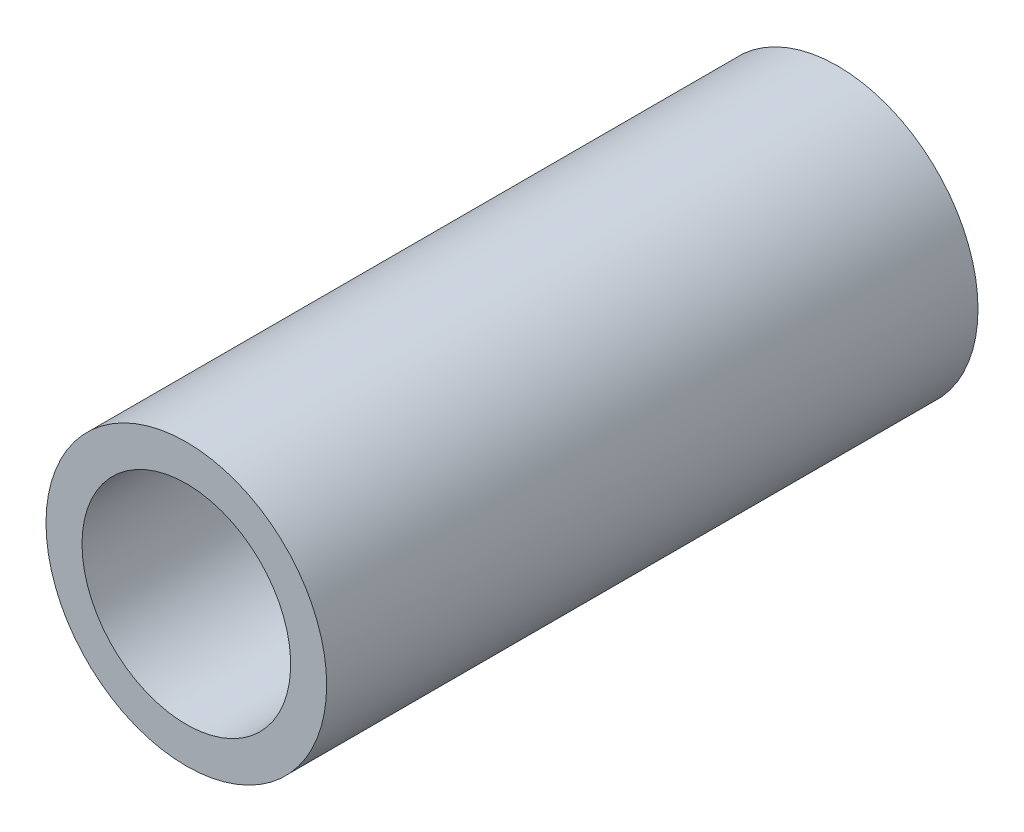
ISO-10303-21;
HEADER;
FILE_DESCRIPTION(('STEP AP214'),'2;1');
FILE_NAME('part.step','',(''),(''),'','','');
FILE_SCHEMA(('AUTOMOTIVE_DESIGN { 1 0 10303 214 1 1 1 1 }'));
ENDSEC;
DATA;
#1=APPLICATION_CONTEXT('core data for automotive mechanical design processes');
#2=APPLICATION_PROTOCOL_DEFINITION('international standard','automotive_design',2000,#1);
#3=PRODUCT_CONTEXT('',#1,'mechanical');
#4=PRODUCT('Part','Part','',(#3));
#5=PRODUCT_RELATED_PRODUCT_CATEGORY('part','',(#4));
#6=PRODUCT_DEFINITION_FORMATION('','',#4);
#7=PRODUCT_DEFINITION_CONTEXT('part definition',#1,'design');
#8=PRODUCT_DEFINITION('design','',#6,#7);
#9=PRODUCT_DEFINITION_SHAPE('','',#8);
#10=(LENGTH_UNIT() NAMED_UNIT(*) SI_UNIT(.MILLI.,.METRE.));
#11=(NAMED_UNIT(*) PLANE_ANGLE_UNIT() SI_UNIT($,.RADIAN.));
#12=(NAMED_UNIT(*) SI_UNIT($,.STERADIAN.) SOLID_ANGLE_UNIT());
#13=UNCERTAINTY_MEASURE_WITH_UNIT(LENGTH_MEASURE(1.E-05),#10,'distance_accuracy_value','');
#14=(GEOMETRIC_REPRESENTATION_CONTEXT(3) GLOBAL_UNCERTAINTY_ASSIGNED_CONTEXT((#13)) GLOBAL_UNIT_ASSIGNED_CONTEXT((#10,
#11,#12)) REPRESENTATION_CONTEXT('',''));
#15=CARTESIAN_POINT('',(0.,0.,0.));
#16=DIRECTION('',(0.,0.,1.));
#17=DIRECTION('',(1.,0.,0.));
#18=AXIS2_PLACEMENT_3D('',#15,#16,#17);
#19=CARTESIAN_POINT('',(0.,0.,31.242));
#20=DIRECTION('',(0.,0.,1.));
#21=DIRECTION('',(1.,0.,0.));
#22=AXIS2_PLACEMENT_3D('',#19,#20,#21);
#23=PLANE('',#22);
#24=CARTESIAN_POINT('',(0.,0.,31.242));
#25=DIRECTION('',(0.,0.,1.));
#26=DIRECTION('',(1.,0.,0.));
#27=AXIS2_PLACEMENT_3D('',#24,#25,#26);
#28=CIRCLE('',#27,6.731);
#29=CARTESIAN_POINT('',(-6.731,0.,31.242));
#30=VERTEX_POINT('',#29);
#31=EDGE_CURVE('E10',#30,#30,#28,.T.);
#32=ORIENTED_EDGE('',*,*,#31,.T.);
#33=EDGE_LOOP('',(#32));
#34=FACE_BOUND('',#33,.T.);
#35=CARTESIAN_POINT('',(0.,0.,31.242));
#36=DIRECTION('',(0.,0.,1.));
#37=DIRECTION('',(1.,0.,0.));
#38=AXIS2_PLACEMENT_3D('',#35,#36,#37);
#39=CIRCLE('',#38,5.0038);
#40=CARTESIAN_POINT('',(-5.0038,0.,31.242));
#41=VERTEX_POINT('',#40);
#42=EDGE_CURVE('E42',#41,#41,#39,.T.);
#43=ORIENTED_EDGE('',*,*,#42,.F.);
#44=EDGE_LOOP('',(#43));
#45=FACE_BOUND('',#44,.T.);
#46=ADVANCED_FACE('F31',(#34,#45),#23,.T.);
#47=CARTESIAN_POINT('',(0.,0.,0.));
#48=DIRECTION('',(0.,0.,1.));
#49=DIRECTION('',(1.,0.,0.));
#50=AXIS2_PLACEMENT_3D('',#47,#48,#49);
#51=PLANE('',#50);
#52=CARTESIAN_POINT('',(0.,0.,0.));
#53=DIRECTION('',(0.,0.,1.));
#54=DIRECTION('',(1.,0.,0.));
#55=AXIS2_PLACEMENT_3D('',#52,#53,#54);
#56=CIRCLE('',#55,6.731);
#57=CARTESIAN_POINT('',(-6.731,0.,0.));
#58=VERTEX_POINT('',#57);
#59=EDGE_CURVE('E35',#58,#58,#56,.T.);
#60=ORIENTED_EDGE('',*,*,#59,.F.);
#61=EDGE_LOOP('',(#60));
#62=FACE_BOUND('',#61,.T.);
#63=CARTESIAN_POINT('',(0.,0.,0.));
#64=DIRECTION('',(0.,0.,1.));
#65=DIRECTION('',(1.,0.,0.));
#66=AXIS2_PLACEMENT_3D('',#63,#64,#65);
#67=CIRCLE('',#66,5.0038);
#68=CARTESIAN_POINT('',(-5.0038,0.,0.));
#69=VERTEX_POINT('',#68);
#70=EDGE_CURVE('E44',#69,#69,#67,.T.);
#71=ORIENTED_EDGE('',*,*,#70,.T.);
#72=EDGE_LOOP('',(#71));
#73=FACE_BOUND('',#72,.T.);
#74=ADVANCED_FACE('F54',(#62,#73),#51,.F.);
#75=CARTESIAN_POINT('',(0.,0.,31.242));
#76=DIRECTION('',(0.,0.,-1.));
#77=DIRECTION('',(-1.,0.,0.));
#78=AXIS2_PLACEMENT_3D('',#75,#76,#77);
#79=CYLINDRICAL_SURFACE('',#78,6.731);
#80=CARTESIAN_POINT('',(-6.731,0.,31.242));
#81=CARTESIAN_POINT('',(-6.731,0.,30.9165625));
#82=CARTESIAN_POINT('',(-6.731,0.,30.591125));
#83=CARTESIAN_POINT('',(-6.731,0.,29.94025));
#84=CARTESIAN_POINT('',(-6.731,0.,29.6148125));
#85=CARTESIAN_POINT('',(-6.731,0.,28.9639375));
#86=CARTESIAN_POINT('',(-6.731,0.,28.6385));
#87=CARTESIAN_POINT('',(-6.731,0.,27.987625));
#88=CARTESIAN_POINT('',(-6.731,0.,27.6621875));
#89=CARTESIAN_POINT('',(-6.731,0.,27.0113125));
#90=CARTESIAN_POINT('',(-6.731,0.,26.685875));
#91=CARTESIAN_POINT('',(-6.731,0.,26.035));
#92=CARTESIAN_POINT('',(-6.731,0.,25.7095625));
#93=CARTESIAN_POINT('',(-6.731,0.,25.0586875));
#94=CARTESIAN_POINT('',(-6.731,0.,24.73325));
#95=CARTESIAN_POINT('',(-6.731,0.,24.082375));
#96=CARTESIAN_POINT('',(-6.731,0.,23.7569375));
#97=CARTESIAN_POINT('',(-6.731,0.,23.1060625));
#98=CARTESIAN_POINT('',(-6.731,0.,22.780625));
#99=CARTESIAN_POINT('',(-6.731,0.,22.12975));
#100=CARTESIAN_POINT('',(-6.731,0.,21.8043125));
#101=CARTESIAN_POINT('',(-6.731,0.,21.1534375));
#102=CARTESIAN_POINT('',(-6.731,0.,20.828));
#103=CARTESIAN_POINT('',(-6.731,0.,20.177125));
#104=CARTESIAN_POINT('',(-6.731,0.,19.8516875));
#105=CARTESIAN_POINT('',(-6.731,0.,19.2008125));
#106=CARTESIAN_POINT('',(-6.731,0.,18.875375));
#107=CARTESIAN_POINT('',(-6.731,0.,18.2245));
#108=CARTESIAN_POINT('',(-6.731,0.,17.8990625));
#109=CARTESIAN_POINT('',(-6.731,0.,17.2481875));
#110=CARTESIAN_POINT('',(-6.731,0.,16.92275));
#111=CARTESIAN_POINT('',(-6.731,0.,16.271875));
#112=CARTESIAN_POINT('',(-6.731,0.,15.9464375));
#113=CARTESIAN_POINT('',(-6.731,0.,15.2955625));
#114=CARTESIAN_POINT('',(-6.731,0.,14.970125));
#115=CARTESIAN_POINT('',(-6.731,0.,14.31925));
#116=CARTESIAN_POINT('',(-6.731,0.,13.9938125));
#117=CARTESIAN_POINT('',(-6.731,0.,13.3429375));
#118=CARTESIAN_POINT('',(-6.731,0.,13.0175));
#119=CARTESIAN_POINT('',(-6.731,0.,12.366625));
#120=CARTESIAN_POINT('',(-6.731,0.,12.0411875));
#121=CARTESIAN_POINT('',(-6.731,0.,11.3903125));
#122=CARTESIAN_POINT('',(-6.731,0.,11.064875));
#123=CARTESIAN_POINT('',(-6.731,0.,10.414));
#124=CARTESIAN_POINT('',(-6.731,0.,10.0885625));
#125=CARTESIAN_POINT('',(-6.731,0.,9.4376875));
#126=CARTESIAN_POINT('',(-6.731,0.,9.11225));
#127=CARTESIAN_POINT('',(-6.731,0.,8.461375));
#128=CARTESIAN_POINT('',(-6.731,0.,8.1359375));
#129=CARTESIAN_POINT('',(-6.731,0.,7.4850625));
#130=CARTESIAN_POINT('',(-6.731,0.,7.159625));
#131=CARTESIAN_POINT('',(-6.731,0.,6.50875));
#132=CARTESIAN_POINT('',(-6.731,0.,6.1833125));
#133=CARTESIAN_POINT('',(-6.731,0.,5.5324375));
#134=CARTESIAN_POINT('',(-6.731,0.,5.207));
#135=CARTESIAN_POINT('',(-6.731,0.,4.556125));
#136=CARTESIAN_POINT('',(-6.731,0.,4.2306875));
#137=CARTESIAN_POINT('',(-6.731,0.,3.5798125));
#138=CARTESIAN_POINT('',(-6.731,0.,3.254375));
#139=CARTESIAN_POINT('',(-6.731,0.,2.6035));
#140=CARTESIAN_POINT('',(-6.731,0.,2.2780625));
#141=CARTESIAN_POINT('',(-6.731,0.,1.6271875));
#142=CARTESIAN_POINT('',(-6.731,0.,1.30175));
#143=CARTESIAN_POINT('',(-6.731,0.,0.650874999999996));
#144=CARTESIAN_POINT('',(-6.731,0.,0.325437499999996));
#145=CARTESIAN_POINT('',(-6.731,0.,0.));
#146=B_SPLINE_CURVE_WITH_KNOTS('',3,(#80,#81,#82,#83,#84,#85,#86,#87,#88,#89,#90,#91,#92,#93,
#94,#95,#96,#97,#98,#99,#100,#101,#102,#103,#104,#105,#106,#107,#108,#109,#110,#111,#112,#113,
#114,#115,#116,#117,#118,#119,#120,#121,#122,#123,#124,#125,#126,#127,#128,#129,#130,#131,#132,
#133,#134,#135,#136,#137,#138,#139,#140,#141,#142,#143,#144,#145),.UNSPECIFIED.,.F.,.F.,(4,2,2,
2,2,2,2,2,2,2,2,2,2,2,2,2,2,2,2,2,2,2,2,2,2,2,2,2,2,2,2,2,4),(0.,0.976312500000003,1.952625,
2.9289375,3.90525,4.8815625,5.857875,6.8341875,7.8105,8.7868125,9.763125,10.7394375,11.71575,
12.6920625,13.668375,14.6446875,15.621,16.5973125,17.573625,18.5499375,19.52625,20.5025625,
21.478875,22.4551875,23.4315,24.4078125,25.384125,26.3604375,27.33675,28.3130625,29.289375,
30.2656875,31.242),.UNSPECIFIED.);
#147=EDGE_CURVE('BSEAM33',#30,#58,#146,.T.);
#148=ORIENTED_EDGE('',*,*,#31,.F.);
#149=ORIENTED_EDGE('',*,*,#59,.T.);
#150=ORIENTED_EDGE('',*,*,#147,.T.);
#151=ORIENTED_EDGE('',*,*,#147,.F.);
#152=EDGE_LOOP('',(#148,#150,#149,#151));
#153=FACE_BOUND('',#152,.T.);
#154=ADVANCED_FACE('F33',(#153),#79,.T.);
#155=CARTESIAN_POINT('',(0.,0.,31.242));
#156=DIRECTION('',(0.,0.,-1.));
#157=DIRECTION('',(-1.,0.,0.));
#158=AXIS2_PLACEMENT_3D('',#155,#156,#157);
#159=CYLINDRICAL_SURFACE('',#158,5.0038);
#160=CARTESIAN_POINT('',(-5.0038,0.,31.242));
#161=CARTESIAN_POINT('',(-5.0038,0.,30.9165625));
#162=CARTESIAN_POINT('',(-5.0038,0.,30.591125));
#163=CARTESIAN_POINT('',(-5.0038,0.,29.94025));
#164=CARTESIAN_POINT('',(-5.0038,0.,29.6148125));
#165=CARTESIAN_POINT('',(-5.0038,0.,28.9639375));
#166=CARTESIAN_POINT('',(-5.0038,0.,28.6385));
#167=CARTESIAN_POINT('',(-5.0038,0.,27.987625));
#168=CARTESIAN_POINT('',(-5.0038,0.,27.6621875));
#169=CARTESIAN_POINT('',(-5.0038,0.,27.0113125));
#170=CARTESIAN_POINT('',(-5.0038,0.,26.685875));
#171=CARTESIAN_POINT('',(-5.0038,0.,26.035));
#172=CARTESIAN_POINT('',(-5.0038,0.,25.7095625));
#173=CARTESIAN_POINT('',(-5.0038,0.,25.0586875));
#174=CARTESIAN_POINT('',(-5.0038,0.,24.73325));
#175=CARTESIAN_POINT('',(-5.0038,0.,24.082375));
#176=CARTESIAN_POINT('',(-5.0038,0.,23.7569375));
#177=CARTESIAN_POINT('',(-5.0038,0.,23.1060625));
#178=CARTESIAN_POINT('',(-5.0038,0.,22.780625));
#179=CARTESIAN_POINT('',(-5.0038,0.,22.12975));
#180=CARTESIAN_POINT('',(-5.0038,0.,21.8043125));
#181=CARTESIAN_POINT('',(-5.0038,0.,21.1534375));
#182=CARTESIAN_POINT('',(-5.0038,0.,20.828));
#183=CARTESIAN_POINT('',(-5.0038,0.,20.177125));
#184=CARTESIAN_POINT('',(-5.0038,0.,19.8516875));
#185=CARTESIAN_POINT('',(-5.0038,0.,19.2008125));
#186=CARTESIAN_POINT('',(-5.0038,0.,18.875375));
#187=CARTESIAN_POINT('',(-5.0038,0.,18.2245));
#188=CARTESIAN_POINT('',(-5.0038,0.,17.8990625));
#189=CARTESIAN_POINT('',(-5.0038,0.,17.2481875));
#190=CARTESIAN_POINT('',(-5.0038,0.,16.92275));
#191=CARTESIAN_POINT('',(-5.0038,0.,16.271875));
#192=CARTESIAN_POINT('',(-5.0038,0.,15.9464375));
#193=CARTESIAN_POINT('',(-5.0038,0.,15.2955625));
#194=CARTESIAN_POINT('',(-5.0038,0.,14.970125));
#195=CARTESIAN_POINT('',(-5.0038,0.,14.31925));
#196=CARTESIAN_POINT('',(-5.0038,0.,13.9938125));
#197=CARTESIAN_POINT('',(-5.0038,0.,13.3429375));
#198=CARTESIAN_POINT('',(-5.0038,0.,13.0175));
#199=CARTESIAN_POINT('',(-5.0038,0.,12.366625));
#200=CARTESIAN_POINT('',(-5.0038,0.,12.0411875));
#201=CARTESIAN_POINT('',(-5.0038,0.,11.3903125));
#202=CARTESIAN_POINT('',(-5.0038,0.,11.064875));
#203=CARTESIAN_POINT('',(-5.0038,0.,10.414));
#204=CARTESIAN_POINT('',(-5.0038,0.,10.0885625));
#205=CARTESIAN_POINT('',(-5.0038,0.,9.4376875));
#206=CARTESIAN_POINT('',(-5.0038,0.,9.11225));
#207=CARTESIAN_POINT('',(-5.0038,0.,8.461375));
#208=CARTESIAN_POINT('',(-5.0038,0.,8.1359375));
#209=CARTESIAN_POINT('',(-5.0038,0.,7.4850625));
#210=CARTESIAN_POINT('',(-5.0038,0.,7.159625));
#211=CARTESIAN_POINT('',(-5.0038,0.,6.50875));
#212=CARTESIAN_POINT('',(-5.0038,0.,6.1833125));
#213=CARTESIAN_POINT('',(-5.0038,0.,5.5324375));
#214=CARTESIAN_POINT('',(-5.0038,0.,5.207));
#215=CARTESIAN_POINT('',(-5.0038,0.,4.556125));
#216=CARTESIAN_POINT('',(-5.0038,0.,4.2306875));
#217=CARTESIAN_POINT('',(-5.0038,0.,3.5798125));
#218=CARTESIAN_POINT('',(-5.0038,0.,3.254375));
#219=CARTESIAN_POINT('',(-5.0038,0.,2.6035));
#220=CARTESIAN_POINT('',(-5.0038,0.,2.2780625));
#221=CARTESIAN_POINT('',(-5.0038,0.,1.6271875));
#222=CARTESIAN_POINT('',(-5.0038,0.,1.30175));
#223=CARTESIAN_POINT('',(-5.0038,0.,0.650874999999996));
#224=CARTESIAN_POINT('',(-5.0038,0.,0.325437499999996));
#225=CARTESIAN_POINT('',(-5.0038,0.,0.));
#226=B_SPLINE_CURVE_WITH_KNOTS('',3,(#160,#161,#162,#163,#164,#165,#166,#167,#168,#169,#170,
#171,#172,#173,#174,#175,#176,#177,#178,#179,#180,#181,#182,#183,#184,#185,#186,#187,#188,#189,
#190,#191,#192,#193,#194,#195,#196,#197,#198,#199,#200,#201,#202,#203,#204,#205,#206,#207,#208,
#209,#210,#211,#212,#213,#214,#215,#216,#217,#218,#219,#220,#221,#222,#223,#224,#225),
.UNSPECIFIED.,.F.,.F.,(4,2,2,2,2,2,2,2,2,2,2,2,2,2,2,2,2,2,2,2,2,2,2,2,2,2,2,2,2,2,2,2,4),(0.,
0.976312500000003,1.952625,2.9289375,3.90525,4.8815625,5.857875,6.8341875,7.8105,8.7868125,
9.763125,10.7394375,11.71575,12.6920625,13.668375,14.6446875,15.621,16.5973125,17.573625,
18.5499375,19.52625,20.5025625,21.478875,22.4551875,23.4315,24.4078125,25.384125,26.3604375,
27.33675,28.3130625,29.289375,30.2656875,31.242),.UNSPECIFIED.);
#227=EDGE_CURVE('BSEAM50',#41,#69,#226,.T.);
#228=ORIENTED_EDGE('',*,*,#42,.T.);
#229=ORIENTED_EDGE('',*,*,#70,.F.);
#230=ORIENTED_EDGE('',*,*,#227,.T.);
#231=ORIENTED_EDGE('',*,*,#227,.F.);
#232=EDGE_LOOP('',(#228,#230,#229,#231));
#233=FACE_BOUND('',#232,.T.);
#234=ADVANCED_FACE('F50',(#233),#159,.F.);
#235=CLOSED_SHELL('',(#46,#74,#154,#234));
#236=MANIFOLD_SOLID_BREP('B2',#235);
#237=ADVANCED_BREP_SHAPE_REPRESENTATION('',(#18,#236),#14);
#238=SHAPE_DEFINITION_REPRESENTATION(#9,#237);
ENDSEC;
END-ISO-10303-21;
